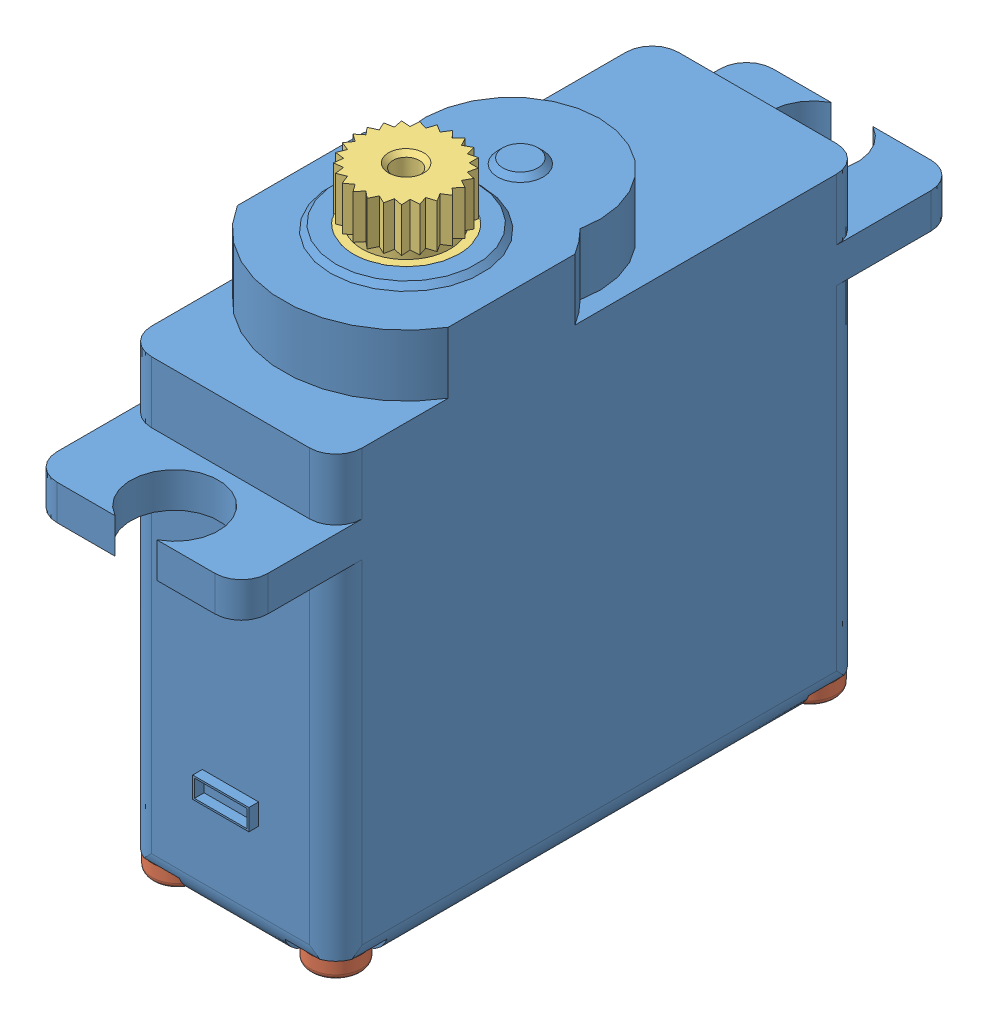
SolidWorks assembly HS-82MG (Micro Server).SLDASM, configuration Default (file format 8000). Lengths in mm.
Overall size (13.01 32.8 40.75).
6 component instances, 3 part files, 10 mates.
Components (placement in the parent):
- Servo Body-1: Servo Body.SLDPRT [Default] at (18.4335 9.184 37.7867) size (12 29.8 40.75)
- screw head-1: screw head.SLDPRT [Default] at (22.9335 10.184 51.2867) x (-0.837169 0 -0.546944) z (-0.546944 0 0.837169) size (2.9 1 2.9)
- screw head-2: screw head.SLDPRT [Default] at (13.9335 10.184 51.2867) x (-0.837169 0 -0.546944) z (-0.546944 0 0.837169) size (2.9 1 2.9)
- screw head-3: screw head.SLDPRT [Default] at (13.9335 10.184 24.2867) x (0.863674 0 0.504051) z (0.504051 0 -0.863674) size (2.9 1 2.9)
- screw head-4: screw head.SLDPRT [Default] at (22.9335 10.184 24.2867) x (-0.837169 0 -0.546944) z (-0.546944 0 0.837169) size (2.9 1 2.9)
- Metal Gear-1: Metal Gear.SLDPRT [Default] at (18.4335 37.984 42.7867) size (6 4 6)
Mates (geometry in assembly coordinates):
- Coincident1: coincident anti-aligned: plane of Servo Body-1 through (22.9335 10.184 51.2867) normal (0 -1 0); plane of screw head-1 through (22.9335 10.184 51.2867) normal (0 1 0)
- Concentric1: concentric anti-aligned: cylinder of Servo Body-1 through (22.9335 10.184 51.2867) axis (0 -1 0) radius 1.5; cylinder of screw head-1 through (22.9335 9.184 51.2867) axis (0 1 0) radius 1.45
- Coincident2: coincident anti-aligned: plane of Servo Body-1 through (13.9335 10.184 51.2867) normal (0 -1 0); plane of screw head-2 through (13.9335 10.184 51.2867) normal (0 1 0)
- Concentric2: concentric anti-aligned: cylinder of Servo Body-1 through (13.9335 10.184 51.2867) axis (0 -1 0) radius 1.5; cylinder of screw head-2 through (13.9335 9.184 51.2867) axis (0 1 0) radius 1.45
- Coincident3: coincident anti-aligned: plane of Servo Body-1 through (22.9335 10.184 24.2867) normal (0 -1 0); plane of screw head-4 through (22.9335 10.184 24.2867) normal (0 1 0)
- Concentric3: concentric anti-aligned: cylinder of Servo Body-1 through (22.9335 10.184 24.2867) axis (0 -1 0) radius 1.5; cylinder of screw head-4 through (22.9335 9.184 24.2867) axis (0 1 0) radius 1.45
- Coincident4: coincident anti-aligned: plane of Servo Body-1 through (13.9335 10.184 24.2867) normal (0 -1 0); plane of screw head-3 through (13.9335 10.184 24.2867) normal (0 1 0)
- Concentric4: concentric anti-aligned: cylinder of Servo Body-1 through (13.9335 10.184 24.2867) axis (0 -1 0) radius 1.5; cylinder of screw head-3 through (13.9335 9.184 24.2867) axis (0 1 0) radius 1.45
- Coincident5: coincident anti-aligned: plane of Servo Body-1 through (18.4335 37.984 42.7867) normal (0 1 0); plane of Metal Gear-1 through (18.4335 37.984 42.7867) normal (0 -1 0)
- Concentric5: concentric anti-aligned: cylinder of Servo Body-1 through (18.4335 37.984 42.7867) axis (0 1 0) radius 3; cylinder of Metal Gear-1 through (18.4335 41.984 42.7867) axis (0 -1 0) radius 3
